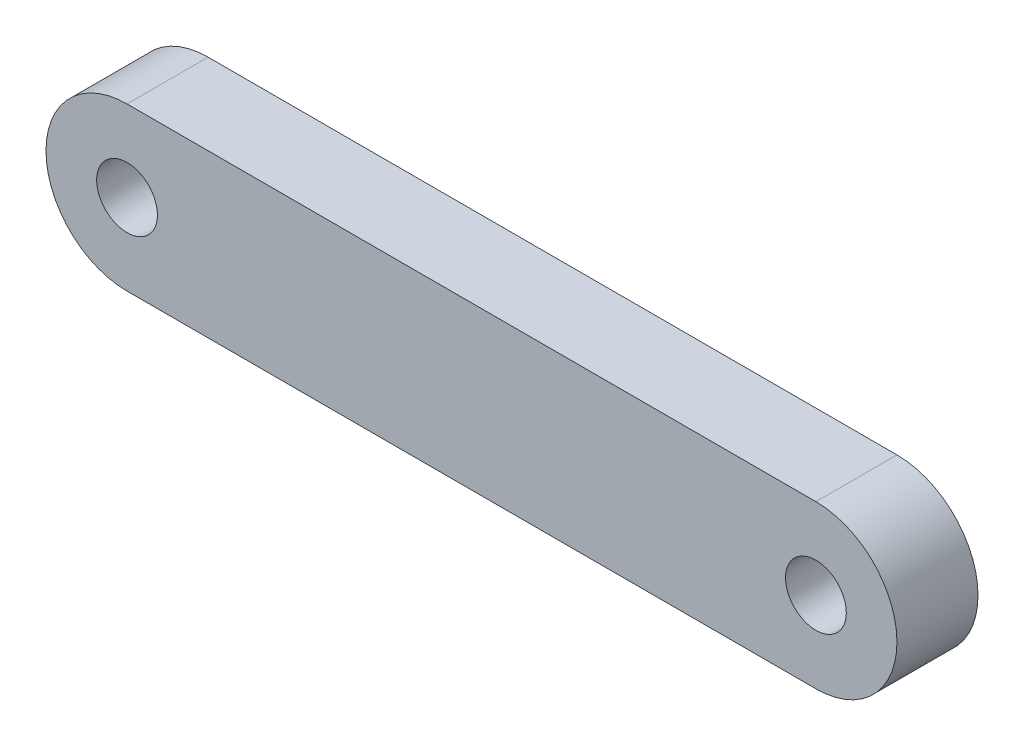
from build123d import *

# Parameters (mm, degrees)
SKETCH_1_R      = 1.5
EXTRUDE_1_DEPTH = 4


with BuildPart() as part:
    # Sketch 1 → Extrude 1 (new body)
    with BuildSketch(Plane.XY):
        with BuildLine():
            Line((15, 4), (49, 4))
            ThreePointArc((49, 4), (53, 0), (49, -4))
            Line((49, -4), (15, -4))
            ThreePointArc((15, -4), (11, 0), (15, 4))
        make_face()
        with Locations((49, 0)):
            Circle(SKETCH_1_R, mode=Mode.SUBTRACT)
        with Locations((15, 0)):
            Circle(SKETCH_1_R, mode=Mode.SUBTRACT)
    extrude(amount=EXTRUDE_1_DEPTH)


solid = part.part
